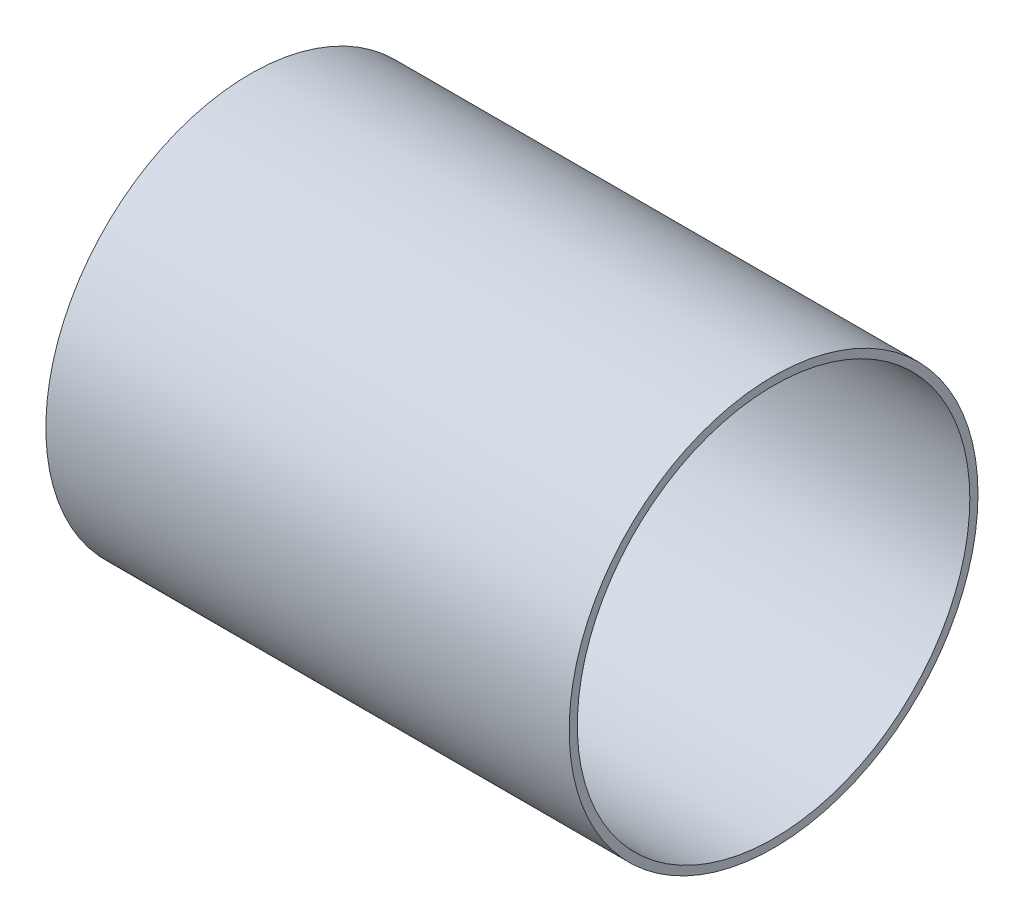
from build123d import *

# Parameters (mm, degrees)
SKETCH1_R              = 79.375
SKETCH1_R_2            = 76.2
CIRCULAR_SECTION_DEPTH = 203.2


with BuildPart() as part:
    # Sketch1 → Circular_section (new body)
    with BuildSketch(Plane.YZ):
        with Locations(Location((0, 0, 0), (0, 0, 270))):
            Circle(SKETCH1_R)
        with Locations(Location((0, 0, 0), (0, 0, 270))):
            Circle(SKETCH1_R_2, mode=Mode.SUBTRACT)
    extrude(amount=CIRCULAR_SECTION_DEPTH)


solid = part.part
